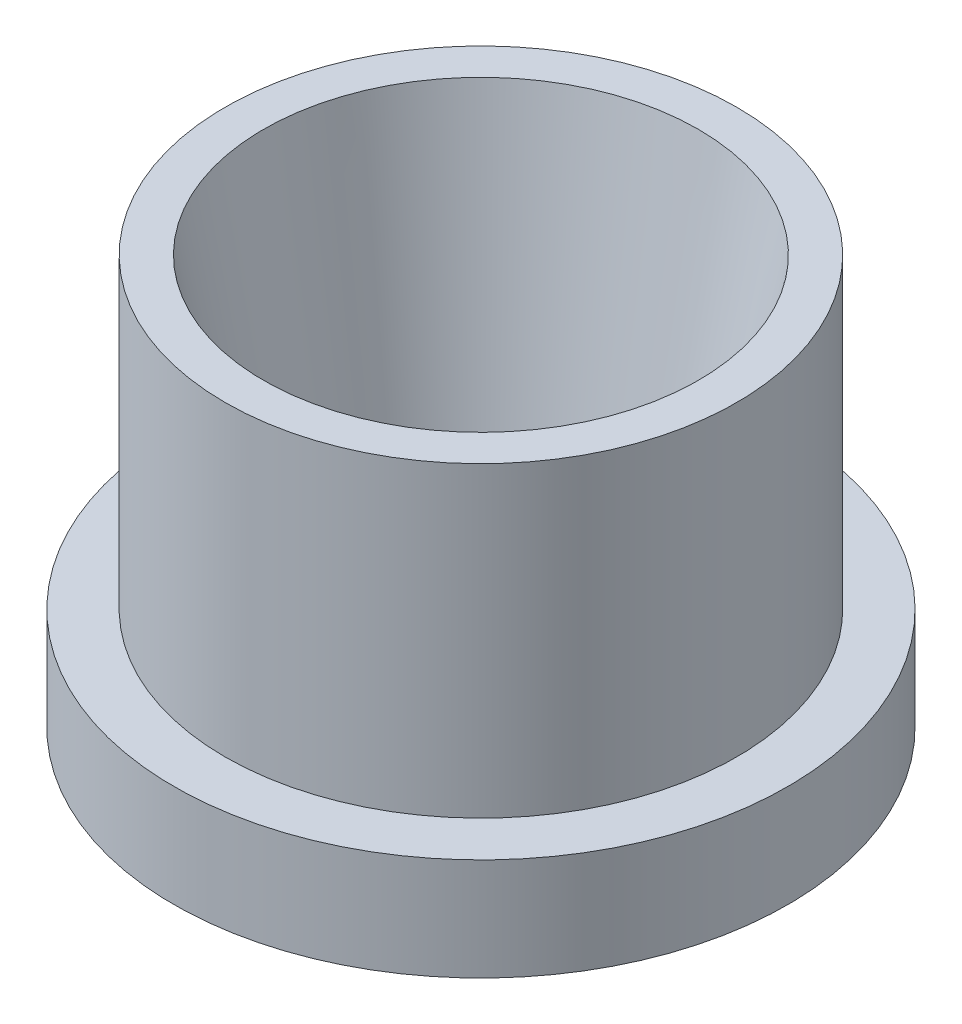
ISO-10303-21;
HEADER;
FILE_DESCRIPTION(('STEP AP214'),'2;1');
FILE_NAME('part.step','',(''),(''),'','','');
FILE_SCHEMA(('AUTOMOTIVE_DESIGN { 1 0 10303 214 1 1 1 1 }'));
ENDSEC;
DATA;
#1=APPLICATION_CONTEXT('core data for automotive mechanical design processes');
#2=APPLICATION_PROTOCOL_DEFINITION('international standard','automotive_design',2000,#1);
#3=PRODUCT_CONTEXT('',#1,'mechanical');
#4=PRODUCT('Part','Part','',(#3));
#5=PRODUCT_RELATED_PRODUCT_CATEGORY('part','',(#4));
#6=PRODUCT_DEFINITION_FORMATION('','',#4);
#7=PRODUCT_DEFINITION_CONTEXT('part definition',#1,'design');
#8=PRODUCT_DEFINITION('design','',#6,#7);
#9=PRODUCT_DEFINITION_SHAPE('','',#8);
#10=(LENGTH_UNIT() NAMED_UNIT(*) SI_UNIT(.MILLI.,.METRE.));
#11=(NAMED_UNIT(*) PLANE_ANGLE_UNIT() SI_UNIT($,.RADIAN.));
#12=(NAMED_UNIT(*) SI_UNIT($,.STERADIAN.) SOLID_ANGLE_UNIT());
#13=UNCERTAINTY_MEASURE_WITH_UNIT(LENGTH_MEASURE(1.E-05),#10,'distance_accuracy_value','');
#14=(GEOMETRIC_REPRESENTATION_CONTEXT(3) GLOBAL_UNCERTAINTY_ASSIGNED_CONTEXT((#13)) GLOBAL_UNIT_ASSIGNED_CONTEXT((#10,
#11,#12)) REPRESENTATION_CONTEXT('',''));
#15=CARTESIAN_POINT('',(0.,0.,0.));
#16=DIRECTION('',(0.,0.,1.));
#17=DIRECTION('',(1.,0.,0.));
#18=AXIS2_PLACEMENT_3D('',#15,#16,#17);
#19=CARTESIAN_POINT('',(6.,0.,0.));
#20=DIRECTION('',(0.,-1.,0.));
#21=DIRECTION('',(0.,0.,-1.));
#22=AXIS2_PLACEMENT_3D('',#19,#20,#21);
#23=PLANE('',#22);
#24=CARTESIAN_POINT('',(0.,0.,0.));
#25=DIRECTION('',(0.,-1.,0.));
#26=DIRECTION('',(0.,0.,-1.));
#27=AXIS2_PLACEMENT_3D('',#24,#25,#26);
#28=CIRCLE('',#27,6.);
#29=CARTESIAN_POINT('',(0.,0.,-6.));
#30=VERTEX_POINT('',#29);
#31=EDGE_CURVE('E10',#30,#30,#28,.T.);
#32=ORIENTED_EDGE('',*,*,#31,.T.);
#33=EDGE_LOOP('',(#32));
#34=FACE_BOUND('',#33,.T.);
#35=CARTESIAN_POINT('',(0.,0.,0.));
#36=DIRECTION('',(0.,-1.,0.));
#37=DIRECTION('',(0.,0.,-1.));
#38=AXIS2_PLACEMENT_3D('',#35,#36,#37);
#39=CIRCLE('',#38,2.79014598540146);
#40=CARTESIAN_POINT('',(0.,0.,-2.79014598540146));
#41=VERTEX_POINT('',#40);
#42=EDGE_CURVE('E54',#41,#41,#39,.T.);
#43=ORIENTED_EDGE('',*,*,#42,.F.);
#44=EDGE_LOOP('',(#43));
#45=FACE_BOUND('',#44,.T.);
#46=ADVANCED_FACE('F32',(#34,#45),#23,.T.);
#47=CARTESIAN_POINT('',(0.,0.,0.));
#48=DIRECTION('',(0.,-1.,0.));
#49=DIRECTION('',(0.,0.,-1.));
#50=AXIS2_PLACEMENT_3D('',#47,#48,#49);
#51=CYLINDRICAL_SURFACE('',#50,6.);
#52=CARTESIAN_POINT('',(0.,2.,0.));
#53=DIRECTION('',(0.,-1.,0.));
#54=DIRECTION('',(0.,0.,-1.));
#55=AXIS2_PLACEMENT_3D('',#52,#53,#54);
#56=CIRCLE('',#55,6.);
#57=CARTESIAN_POINT('',(0.,2.,-6.));
#58=VERTEX_POINT('',#57);
#59=EDGE_CURVE('E38',#58,#58,#56,.T.);
#60=ORIENTED_EDGE('',*,*,#59,.T.);
#61=EDGE_LOOP('',(#60));
#62=FACE_BOUND('',#61,.T.);
#63=ORIENTED_EDGE('',*,*,#31,.F.);
#64=EDGE_LOOP('',(#63));
#65=FACE_BOUND('',#64,.T.);
#66=ADVANCED_FACE('F62',(#62,#65),#51,.T.);
#67=CARTESIAN_POINT('',(5.,2.,0.));
#68=DIRECTION('',(0.,1.,0.));
#69=DIRECTION('',(0.,0.,1.));
#70=AXIS2_PLACEMENT_3D('',#67,#68,#69);
#71=PLANE('',#70);
#72=CARTESIAN_POINT('',(0.,2.,0.));
#73=DIRECTION('',(0.,-1.,0.));
#74=DIRECTION('',(0.,0.,-1.));
#75=AXIS2_PLACEMENT_3D('',#72,#73,#74);
#76=CIRCLE('',#75,5.);
#77=CARTESIAN_POINT('',(0.,2.,-5.));
#78=VERTEX_POINT('',#77);
#79=EDGE_CURVE('E42',#78,#78,#76,.T.);
#80=ORIENTED_EDGE('',*,*,#79,.T.);
#81=EDGE_LOOP('',(#80));
#82=FACE_BOUND('',#81,.T.);
#83=ORIENTED_EDGE('',*,*,#59,.F.);
#84=EDGE_LOOP('',(#83));
#85=FACE_BOUND('',#84,.T.);
#86=ADVANCED_FACE('F66',(#82,#85),#71,.T.);
#87=CARTESIAN_POINT('',(0.,0.,0.));
#88=DIRECTION('',(0.,-1.,0.));
#89=DIRECTION('',(0.,0.,-1.));
#90=AXIS2_PLACEMENT_3D('',#87,#88,#89);
#91=CYLINDRICAL_SURFACE('',#90,5.);
#92=CARTESIAN_POINT('',(0.,8.,0.));
#93=DIRECTION('',(0.,-1.,0.));
#94=DIRECTION('',(0.,0.,-1.));
#95=AXIS2_PLACEMENT_3D('',#92,#93,#94);
#96=CIRCLE('',#95,5.);
#97=CARTESIAN_POINT('',(0.,8.,-5.));
#98=VERTEX_POINT('',#97);
#99=EDGE_CURVE('E46',#98,#98,#96,.T.);
#100=ORIENTED_EDGE('',*,*,#99,.T.);
#101=EDGE_LOOP('',(#100));
#102=FACE_BOUND('',#101,.T.);
#103=ORIENTED_EDGE('',*,*,#79,.F.);
#104=EDGE_LOOP('',(#103));
#105=FACE_BOUND('',#104,.T.);
#106=ADVANCED_FACE('F70',(#102,#105),#91,.T.);
#107=CARTESIAN_POINT('',(4.25,8.,0.));
#108=DIRECTION('',(0.,1.,0.));
#109=DIRECTION('',(0.,0.,1.));
#110=AXIS2_PLACEMENT_3D('',#107,#108,#109);
#111=PLANE('',#110);
#112=CARTESIAN_POINT('',(0.,8.,0.));
#113=DIRECTION('',(0.,-1.,0.));
#114=DIRECTION('',(0.,0.,-1.));
#115=AXIS2_PLACEMENT_3D('',#112,#113,#114);
#116=CIRCLE('',#115,4.25);
#117=CARTESIAN_POINT('',(0.,8.,-4.25));
#118=VERTEX_POINT('',#117);
#119=EDGE_CURVE('E51',#118,#118,#116,.T.);
#120=ORIENTED_EDGE('',*,*,#119,.T.);
#121=EDGE_LOOP('',(#120));
#122=FACE_BOUND('',#121,.T.);
#123=ORIENTED_EDGE('',*,*,#99,.F.);
#124=EDGE_LOOP('',(#123));
#125=FACE_BOUND('',#124,.T.);
#126=ADVANCED_FACE('F77',(#122,#125),#111,.T.);
#127=CARTESIAN_POINT('',(0.,8.,0.));
#128=DIRECTION('',(0.,1.,0.));
#129=DIRECTION('',(0.,0.,1.));
#130=AXIS2_PLACEMENT_3D('',#127,#128,#129);
#131=CONICAL_SURFACE('',#130,4.25,0.180495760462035);
#132=ORIENTED_EDGE('',*,*,#42,.T.);
#133=EDGE_LOOP('',(#132));
#134=FACE_BOUND('',#133,.T.);
#135=ORIENTED_EDGE('',*,*,#119,.F.);
#136=EDGE_LOOP('',(#135));
#137=FACE_BOUND('',#136,.T.);
#138=ADVANCED_FACE('F58',(#134,#137),#131,.F.);
#139=CLOSED_SHELL('',(#46,#66,#86,#106,#126,#138));
#140=MANIFOLD_SOLID_BREP('B2',#139);
#141=ADVANCED_BREP_SHAPE_REPRESENTATION('',(#18,#140),#14);
#142=SHAPE_DEFINITION_REPRESENTATION(#9,#141);
ENDSEC;
END-ISO-10303-21;
